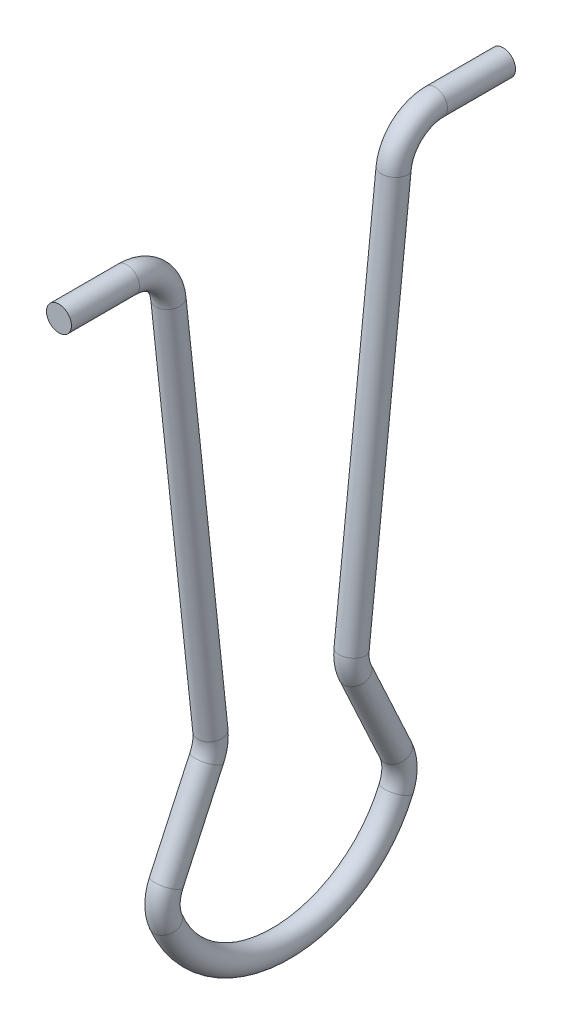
ISO-10303-21;
HEADER;
FILE_DESCRIPTION(('STEP AP214'),'2;1');
FILE_NAME('part.step','',(''),(''),'','','');
FILE_SCHEMA(('AUTOMOTIVE_DESIGN { 1 0 10303 214 1 1 1 1 }'));
ENDSEC;
DATA;
#1=APPLICATION_CONTEXT('core data for automotive mechanical design processes');
#2=APPLICATION_PROTOCOL_DEFINITION('international standard','automotive_design',2000,#1);
#3=PRODUCT_CONTEXT('',#1,'mechanical');
#4=PRODUCT('Part','Part','',(#3));
#5=PRODUCT_RELATED_PRODUCT_CATEGORY('part','',(#4));
#6=PRODUCT_DEFINITION_FORMATION('','',#4);
#7=PRODUCT_DEFINITION_CONTEXT('part definition',#1,'design');
#8=PRODUCT_DEFINITION('design','',#6,#7);
#9=PRODUCT_DEFINITION_SHAPE('','',#8);
#10=(LENGTH_UNIT() NAMED_UNIT(*) SI_UNIT(.MILLI.,.METRE.));
#11=(NAMED_UNIT(*) PLANE_ANGLE_UNIT() SI_UNIT($,.RADIAN.));
#12=(NAMED_UNIT(*) SI_UNIT($,.STERADIAN.) SOLID_ANGLE_UNIT());
#13=UNCERTAINTY_MEASURE_WITH_UNIT(LENGTH_MEASURE(1.E-05),#10,'distance_accuracy_value','');
#14=(GEOMETRIC_REPRESENTATION_CONTEXT(3) GLOBAL_UNCERTAINTY_ASSIGNED_CONTEXT((#13)) GLOBAL_UNIT_ASSIGNED_CONTEXT((#10,
#11,#12)) REPRESENTATION_CONTEXT('',''));
#15=CARTESIAN_POINT('',(0.,0.,0.));
#16=DIRECTION('',(0.,0.,1.));
#17=DIRECTION('',(1.,0.,0.));
#18=AXIS2_PLACEMENT_3D('',#15,#16,#17);
#19=CARTESIAN_POINT('',(0.,0.,16.));
#20=DIRECTION('',(0.,0.,-1.));
#21=DIRECTION('',(0.,1.,0.));
#22=AXIS2_PLACEMENT_3D('',#19,#20,#21);
#23=PLANE('',#22);
#24=CARTESIAN_POINT('',(0.,0.,16.));
#25=DIRECTION('',(0.,0.,-1.));
#26=DIRECTION('',(0.,1.,0.));
#27=AXIS2_PLACEMENT_3D('',#24,#25,#26);
#28=CIRCLE('',#27,0.9);
#29=CARTESIAN_POINT('',(0.,0.899999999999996,16.));
#30=VERTEX_POINT('',#29);
#31=EDGE_CURVE('E88',#30,#30,#28,.T.);
#32=ORIENTED_EDGE('',*,*,#31,.F.);
#33=EDGE_LOOP('',(#32));
#34=FACE_BOUND('',#33,.T.);
#35=ADVANCED_FACE('F42',(#34),#23,.F.);
#36=CARTESIAN_POINT('',(0.,0.,-16.));
#37=DIRECTION('',(0.,0.,-1.));
#38=DIRECTION('',(0.,1.,0.));
#39=AXIS2_PLACEMENT_3D('',#36,#37,#38);
#40=PLANE('',#39);
#41=CARTESIAN_POINT('',(0.,0.,-16.));
#42=DIRECTION('',(0.,0.,-1.));
#43=DIRECTION('',(0.,1.,0.));
#44=AXIS2_PLACEMENT_3D('',#41,#42,#43);
#45=CIRCLE('',#44,0.9);
#46=CARTESIAN_POINT('',(0.,0.899999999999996,-16.));
#47=VERTEX_POINT('',#46);
#48=EDGE_CURVE('E11',#47,#47,#45,.T.);
#49=ORIENTED_EDGE('',*,*,#48,.T.);
#50=EDGE_LOOP('',(#49));
#51=FACE_BOUND('',#50,.T.);
#52=ADVANCED_FACE('F95',(#51),#40,.T.);
#53=CARTESIAN_POINT('',(0.,0.,16.));
#54=DIRECTION('',(0.,0.,-1.));
#55=DIRECTION('',(0.,1.,0.));
#56=AXIS2_PLACEMENT_3D('',#53,#54,#55);
#57=CYLINDRICAL_SURFACE('',#56,0.9);
#58=CARTESIAN_POINT('',(0.,0.,11.0981360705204));
#59=DIRECTION('',(0.,0.,-1.));
#60=DIRECTION('',(0.,1.,0.));
#61=AXIS2_PLACEMENT_3D('',#58,#59,#60);
#62=CIRCLE('',#61,0.9);
#63=CARTESIAN_POINT('',(0.,0.900000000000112,11.0981360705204));
#64=VERTEX_POINT('',#63);
#65=EDGE_CURVE('E85',#64,#64,#62,.T.);
#66=ORIENTED_EDGE('',*,*,#65,.F.);
#67=EDGE_LOOP('',(#66));
#68=FACE_BOUND('',#67,.T.);
#69=ORIENTED_EDGE('',*,*,#31,.T.);
#70=EDGE_LOOP('',(#69));
#71=FACE_BOUND('',#70,.T.);
#72=ADVANCED_FACE('F92',(#68,#71),#57,.T.);
#73=CARTESIAN_POINT('',(0.,-3.,11.0981360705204));
#74=DIRECTION('',(-1.,0.,0.));
#75=DIRECTION('',(0.,0.,1.));
#76=AXIS2_PLACEMENT_3D('',#73,#74,#75);
#77=TOROIDAL_SURFACE('',#76,3.00000000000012,0.9);
#78=CARTESIAN_POINT('',(0.,-2.68303410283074,8.11492762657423));
#79=DIRECTION('',(0.,-0.994402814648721,-0.10565529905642));
#80=DIRECTION('',(0.,0.10565529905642,-0.994402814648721));
#81=AXIS2_PLACEMENT_3D('',#78,#79,#80);
#82=CIRCLE('',#81,0.9);
#83=CARTESIAN_POINT('',(0.,-2.58794433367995,7.21996509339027));
#84=VERTEX_POINT('',#83);
#85=EDGE_CURVE('E82',#84,#84,#82,.T.);
#86=CARTESIAN_POINT('',(0.,-3.,11.0981360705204));
#87=DIRECTION('',(-1.,0.,0.));
#88=DIRECTION('',(0.,0.,1.));
#89=AXIS2_PLACEMENT_3D('',#86,#87,#88);
#90=CIRCLE('',#89,3.90000000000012);
#91=EDGE_CURVE('',#64,#84,#90,.T.);
#92=ORIENTED_EDGE('',*,*,#65,.T.);
#93=ORIENTED_EDGE('',*,*,#85,.F.);
#94=ORIENTED_EDGE('',*,*,#91,.T.);
#95=ORIENTED_EDGE('',*,*,#91,.F.);
#96=EDGE_LOOP('',(#92,#94,#93,#95));
#97=FACE_BOUND('',#96,.T.);
#98=ADVANCED_FACE('F145',(#97),#77,.T.);
#99=CARTESIAN_POINT('',(0.,-2.68303410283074,8.11492762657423));
#100=DIRECTION('',(0.,-0.99440281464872,-0.105655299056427));
#101=DIRECTION('',(0.,0.105655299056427,-0.99440281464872));
#102=AXIS2_PLACEMENT_3D('',#99,#100,#101);
#103=CYLINDRICAL_SURFACE('',#102,0.9);
#104=CARTESIAN_POINT('',(0.,-31.1757747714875,5.08757393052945));
#105=DIRECTION('',(0.,-0.99440281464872,-0.105655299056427));
#106=DIRECTION('',(0.,0.105655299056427,-0.99440281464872));
#107=AXIS2_PLACEMENT_3D('',#104,#105,#106);
#108=CIRCLE('',#107,0.9);
#109=CARTESIAN_POINT('',(0.,-31.0806850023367,4.1926113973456));
#110=VERTEX_POINT('',#109);
#111=EDGE_CURVE('E79',#110,#110,#108,.T.);
#112=ORIENTED_EDGE('',*,*,#111,.F.);
#113=EDGE_LOOP('',(#112));
#114=FACE_BOUND('',#113,.T.);
#115=ORIENTED_EDGE('',*,*,#85,.T.);
#116=EDGE_LOOP('',(#115));
#117=FACE_BOUND('',#116,.T.);
#118=ADVANCED_FACE('F141',(#114,#117),#103,.T.);
#119=CARTESIAN_POINT('',(0.,-31.4927406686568,8.07078237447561));
#120=DIRECTION('',(-1.,0.,0.));
#121=DIRECTION('',(0.,0.,1.));
#122=AXIS2_PLACEMENT_3D('',#119,#120,#121);
#123=TOROIDAL_SURFACE('',#122,3.,0.9);
#124=CARTESIAN_POINT('',(0.,-32.7522741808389,5.3479942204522));
#125=DIRECTION('',(0.,-0.907596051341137,0.419844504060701));
#126=DIRECTION('',(0.,-0.419844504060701,-0.907596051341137));
#127=AXIS2_PLACEMENT_3D('',#124,#125,#126);
#128=CIRCLE('',#127,0.9);
#129=CARTESIAN_POINT('',(0.,-33.1301342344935,4.53115777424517));
#130=VERTEX_POINT('',#129);
#131=EDGE_CURVE('E76',#130,#130,#128,.T.);
#132=CARTESIAN_POINT('',(0.,-31.4927406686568,8.07078237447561));
#133=DIRECTION('',(-1.,0.,0.));
#134=DIRECTION('',(0.,0.,1.));
#135=AXIS2_PLACEMENT_3D('',#132,#133,#134);
#136=CIRCLE('',#135,3.9);
#137=EDGE_CURVE('',#110,#130,#136,.T.);
#138=ORIENTED_EDGE('',*,*,#111,.T.);
#139=ORIENTED_EDGE('',*,*,#131,.F.);
#140=ORIENTED_EDGE('',*,*,#137,.T.);
#141=ORIENTED_EDGE('',*,*,#137,.F.);
#142=EDGE_LOOP('',(#138,#140,#139,#141));
#143=FACE_BOUND('',#142,.T.);
#144=ADVANCED_FACE('F137',(#143),#123,.T.);
#145=CARTESIAN_POINT('',(0.,-32.7522741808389,5.3479942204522));
#146=DIRECTION('',(0.,-0.907596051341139,0.419844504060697));
#147=DIRECTION('',(0.,-0.419844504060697,-0.907596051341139));
#148=AXIS2_PLACEMENT_3D('',#145,#146,#147);
#149=CYLINDRICAL_SURFACE('',#148,0.9);
#150=CARTESIAN_POINT('',(0.,-39.0491193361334,8.26084936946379));
#151=DIRECTION('',(0.,-0.907596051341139,0.419844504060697));
#152=DIRECTION('',(0.,-0.419844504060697,-0.907596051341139));
#153=AXIS2_PLACEMENT_3D('',#150,#151,#152);
#154=CIRCLE('',#153,0.9);
#155=CARTESIAN_POINT('',(0.,-38.6712592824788,9.07768581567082));
#156=VERTEX_POINT('',#155);
#157=EDGE_CURVE('E73',#156,#156,#154,.T.);
#158=ORIENTED_EDGE('',*,*,#157,.F.);
#159=EDGE_LOOP('',(#158));
#160=FACE_BOUND('',#159,.T.);
#161=ORIENTED_EDGE('',*,*,#131,.T.);
#162=EDGE_LOOP('',(#161));
#163=FACE_BOUND('',#162,.T.);
#164=ADVANCED_FACE('F133',(#160,#163),#149,.T.);
#165=CARTESIAN_POINT('',(0.,-40.3086528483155,5.53806121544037));
#166=DIRECTION('',(1.,0.,0.));
#167=DIRECTION('',(0.,0.,-1.));
#168=AXIS2_PLACEMENT_3D('',#165,#166,#167);
#169=TOROIDAL_SURFACE('',#168,3.,0.9);
#170=CARTESIAN_POINT('',(0.,-41.4629792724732,8.30709182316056));
#171=DIRECTION('',(0.,-0.923010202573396,-0.384775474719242));
#172=DIRECTION('',(0.,0.384775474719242,-0.923010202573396));
#173=AXIS2_PLACEMENT_3D('',#170,#171,#172);
#174=CIRCLE('',#173,0.9);
#175=CARTESIAN_POINT('',(0.,-41.8092771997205,9.13780100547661));
#176=VERTEX_POINT('',#175);
#177=EDGE_CURVE('E70',#176,#176,#174,.T.);
#178=CARTESIAN_POINT('',(0.,-40.3086528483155,5.53806121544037));
#179=DIRECTION('',(1.,0.,0.));
#180=DIRECTION('',(0.,0.,-1.));
#181=AXIS2_PLACEMENT_3D('',#178,#179,#180);
#182=CIRCLE('',#181,3.9);
#183=EDGE_CURVE('',#156,#176,#182,.T.);
#184=ORIENTED_EDGE('',*,*,#157,.T.);
#185=ORIENTED_EDGE('',*,*,#177,.F.);
#186=ORIENTED_EDGE('',*,*,#183,.T.);
#187=ORIENTED_EDGE('',*,*,#183,.F.);
#188=EDGE_LOOP('',(#184,#186,#185,#187));
#189=FACE_BOUND('',#188,.T.);
#190=ADVANCED_FACE('F129',(#189),#169,.T.);
#191=CARTESIAN_POINT('',(0.,-38.,0.));
#192=DIRECTION('',(1.,0.,0.));
#193=DIRECTION('',(0.,0.,-1.));
#194=AXIS2_PLACEMENT_3D('',#191,#192,#193);
#195=TOROIDAL_SURFACE('',#194,9.,0.9);
#196=CARTESIAN_POINT('',(0.,-41.4629792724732,-8.30709182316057));
#197=DIRECTION('',(0.,0.923010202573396,-0.384775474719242));
#198=DIRECTION('',(0.,0.384775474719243,0.923010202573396));
#199=AXIS2_PLACEMENT_3D('',#196,#197,#198);
#200=CIRCLE('',#199,0.9);
#201=CARTESIAN_POINT('',(0.,-41.8092771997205,-9.13780100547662));
#202=VERTEX_POINT('',#201);
#203=EDGE_CURVE('E67',#202,#202,#200,.T.);
#204=CARTESIAN_POINT('',(0.,-38.,0.));
#205=DIRECTION('',(1.,0.,0.));
#206=DIRECTION('',(0.,0.,-1.));
#207=AXIS2_PLACEMENT_3D('',#204,#205,#206);
#208=CIRCLE('',#207,9.9);
#209=EDGE_CURVE('',#176,#202,#208,.T.);
#210=ORIENTED_EDGE('',*,*,#177,.T.);
#211=ORIENTED_EDGE('',*,*,#203,.F.);
#212=ORIENTED_EDGE('',*,*,#209,.T.);
#213=ORIENTED_EDGE('',*,*,#209,.F.);
#214=EDGE_LOOP('',(#210,#212,#211,#213));
#215=FACE_BOUND('',#214,.T.);
#216=ADVANCED_FACE('F125',(#215),#195,.T.);
#217=CARTESIAN_POINT('',(0.,-40.3086528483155,-5.53806121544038));
#218=DIRECTION('',(1.,0.,0.));
#219=DIRECTION('',(0.,0.,-1.));
#220=AXIS2_PLACEMENT_3D('',#217,#218,#219);
#221=TOROIDAL_SURFACE('',#220,3.,0.9);
#222=CARTESIAN_POINT('',(0.,-39.0491193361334,-8.2608493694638));
#223=DIRECTION('',(0.,0.907596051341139,0.419844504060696));
#224=DIRECTION('',(0.,-0.419844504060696,0.907596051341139));
#225=AXIS2_PLACEMENT_3D('',#222,#223,#224);
#226=CIRCLE('',#225,0.9);
#227=CARTESIAN_POINT('',(0.,-38.6712592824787,-9.07768581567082));
#228=VERTEX_POINT('',#227);
#229=EDGE_CURVE('E64',#228,#228,#226,.T.);
#230=CARTESIAN_POINT('',(0.,-40.3086528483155,-5.53806121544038));
#231=DIRECTION('',(1.,0.,0.));
#232=DIRECTION('',(0.,0.,-1.));
#233=AXIS2_PLACEMENT_3D('',#230,#231,#232);
#234=CIRCLE('',#233,3.9);
#235=EDGE_CURVE('',#202,#228,#234,.T.);
#236=ORIENTED_EDGE('',*,*,#203,.T.);
#237=ORIENTED_EDGE('',*,*,#229,.F.);
#238=ORIENTED_EDGE('',*,*,#235,.T.);
#239=ORIENTED_EDGE('',*,*,#235,.F.);
#240=EDGE_LOOP('',(#236,#238,#237,#239));
#241=FACE_BOUND('',#240,.T.);
#242=ADVANCED_FACE('F121',(#241),#221,.T.);
#243=CARTESIAN_POINT('',(0.,-39.0491193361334,-8.2608493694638));
#244=DIRECTION('',(0.,0.907596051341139,0.419844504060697));
#245=DIRECTION('',(0.,-0.419844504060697,0.907596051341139));
#246=AXIS2_PLACEMENT_3D('',#243,#244,#245);
#247=CYLINDRICAL_SURFACE('',#246,0.9);
#248=CARTESIAN_POINT('',(0.,-32.7522741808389,-5.34799422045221));
#249=DIRECTION('',(0.,0.907596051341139,0.419844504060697));
#250=DIRECTION('',(0.,-0.419844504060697,0.907596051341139));
#251=AXIS2_PLACEMENT_3D('',#248,#249,#250);
#252=CIRCLE('',#251,0.9);
#253=CARTESIAN_POINT('',(0.,-33.1301342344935,-4.53115777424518));
#254=VERTEX_POINT('',#253);
#255=EDGE_CURVE('E61',#254,#254,#252,.T.);
#256=ORIENTED_EDGE('',*,*,#255,.F.);
#257=EDGE_LOOP('',(#256));
#258=FACE_BOUND('',#257,.T.);
#259=ORIENTED_EDGE('',*,*,#229,.T.);
#260=EDGE_LOOP('',(#259));
#261=FACE_BOUND('',#260,.T.);
#262=ADVANCED_FACE('F117',(#258,#261),#247,.T.);
#263=CARTESIAN_POINT('',(0.,-31.4927406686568,-8.07078237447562));
#264=DIRECTION('',(-1.,0.,0.));
#265=DIRECTION('',(0.,0.,1.));
#266=AXIS2_PLACEMENT_3D('',#263,#264,#265);
#267=TOROIDAL_SURFACE('',#266,3.,0.9);
#268=CARTESIAN_POINT('',(0.,-31.1757747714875,-5.08757393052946));
#269=DIRECTION('',(0.,0.99440281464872,-0.10565529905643));
#270=DIRECTION('',(0.,0.10565529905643,0.99440281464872));
#271=AXIS2_PLACEMENT_3D('',#268,#269,#270);
#272=CIRCLE('',#271,0.9);
#273=CARTESIAN_POINT('',(0.,-31.0806850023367,-4.19261139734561));
#274=VERTEX_POINT('',#273);
#275=EDGE_CURVE('E56',#274,#274,#272,.T.);
#276=CARTESIAN_POINT('',(0.,-31.4927406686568,-8.07078237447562));
#277=DIRECTION('',(-1.,0.,0.));
#278=DIRECTION('',(0.,0.,1.));
#279=AXIS2_PLACEMENT_3D('',#276,#277,#278);
#280=CIRCLE('',#279,3.9);
#281=EDGE_CURVE('',#254,#274,#280,.T.);
#282=ORIENTED_EDGE('',*,*,#255,.T.);
#283=ORIENTED_EDGE('',*,*,#275,.F.);
#284=ORIENTED_EDGE('',*,*,#281,.T.);
#285=ORIENTED_EDGE('',*,*,#281,.F.);
#286=EDGE_LOOP('',(#282,#284,#283,#285));
#287=FACE_BOUND('',#286,.T.);
#288=ADVANCED_FACE('F113',(#287),#267,.T.);
#289=CARTESIAN_POINT('',(0.,-31.1757747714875,-5.08757393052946));
#290=DIRECTION('',(0.,0.99440281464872,-0.105655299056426));
#291=DIRECTION('',(0.,0.105655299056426,0.99440281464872));
#292=AXIS2_PLACEMENT_3D('',#289,#290,#291);
#293=CYLINDRICAL_SURFACE('',#292,0.9);
#294=CARTESIAN_POINT('',(0.,-2.68303410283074,-8.11492762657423));
#295=DIRECTION('',(0.,0.99440281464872,-0.105655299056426));
#296=DIRECTION('',(0.,0.105655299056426,0.99440281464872));
#297=AXIS2_PLACEMENT_3D('',#294,#295,#296);
#298=CIRCLE('',#297,0.9);
#299=CARTESIAN_POINT('',(0.,-2.58794433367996,-7.21996509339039));
#300=VERTEX_POINT('',#299);
#301=EDGE_CURVE('E52',#300,#300,#298,.T.);
#302=ORIENTED_EDGE('',*,*,#301,.F.);
#303=EDGE_LOOP('',(#302));
#304=FACE_BOUND('',#303,.T.);
#305=ORIENTED_EDGE('',*,*,#275,.T.);
#306=EDGE_LOOP('',(#305));
#307=FACE_BOUND('',#306,.T.);
#308=ADVANCED_FACE('F107',(#304,#307),#293,.T.);
#309=CARTESIAN_POINT('',(0.,-3.,-11.0981360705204));
#310=DIRECTION('',(-1.,0.,0.));
#311=DIRECTION('',(0.,0.,1.));
#312=AXIS2_PLACEMENT_3D('',#309,#310,#311);
#313=TOROIDAL_SURFACE('',#312,3.,0.9);
#314=CARTESIAN_POINT('',(0.,0.,-11.0981360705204));
#315=DIRECTION('',(0.,0.,-1.));
#316=DIRECTION('',(0.,1.,0.));
#317=AXIS2_PLACEMENT_3D('',#314,#315,#316);
#318=CIRCLE('',#317,0.9);
#319=CARTESIAN_POINT('',(0.,0.900000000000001,-11.0981360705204));
#320=VERTEX_POINT('',#319);
#321=EDGE_CURVE('E48',#320,#320,#318,.T.);
#322=CARTESIAN_POINT('',(0.,-3.,-11.0981360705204));
#323=DIRECTION('',(-1.,0.,0.));
#324=DIRECTION('',(0.,0.,1.));
#325=AXIS2_PLACEMENT_3D('',#322,#323,#324);
#326=CIRCLE('',#325,3.9);
#327=EDGE_CURVE('',#300,#320,#326,.T.);
#328=ORIENTED_EDGE('',*,*,#301,.T.);
#329=ORIENTED_EDGE('',*,*,#321,.F.);
#330=ORIENTED_EDGE('',*,*,#327,.T.);
#331=ORIENTED_EDGE('',*,*,#327,.F.);
#332=EDGE_LOOP('',(#328,#330,#329,#331));
#333=FACE_BOUND('',#332,.T.);
#334=ADVANCED_FACE('F101',(#333),#313,.T.);
#335=CARTESIAN_POINT('',(0.,0.,-11.0981360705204));
#336=DIRECTION('',(0.,0.,-1.));
#337=DIRECTION('',(0.,1.,0.));
#338=AXIS2_PLACEMENT_3D('',#335,#336,#337);
#339=CYLINDRICAL_SURFACE('',#338,0.9);
#340=ORIENTED_EDGE('',*,*,#48,.F.);
#341=EDGE_LOOP('',(#340));
#342=FACE_BOUND('',#341,.T.);
#343=ORIENTED_EDGE('',*,*,#321,.T.);
#344=EDGE_LOOP('',(#343));
#345=FACE_BOUND('',#344,.T.);
#346=ADVANCED_FACE('F99',(#342,#345),#339,.T.);
#347=CLOSED_SHELL('',(#35,#52,#72,#98,#118,#144,#164,#190,#216,#242,#262,#288,#308,#334,#346));
#348=MANIFOLD_SOLID_BREP('B2',#347);
#349=ADVANCED_BREP_SHAPE_REPRESENTATION('',(#18,#348),#14);
#350=SHAPE_DEFINITION_REPRESENTATION(#9,#349);
ENDSEC;
END-ISO-10303-21;
